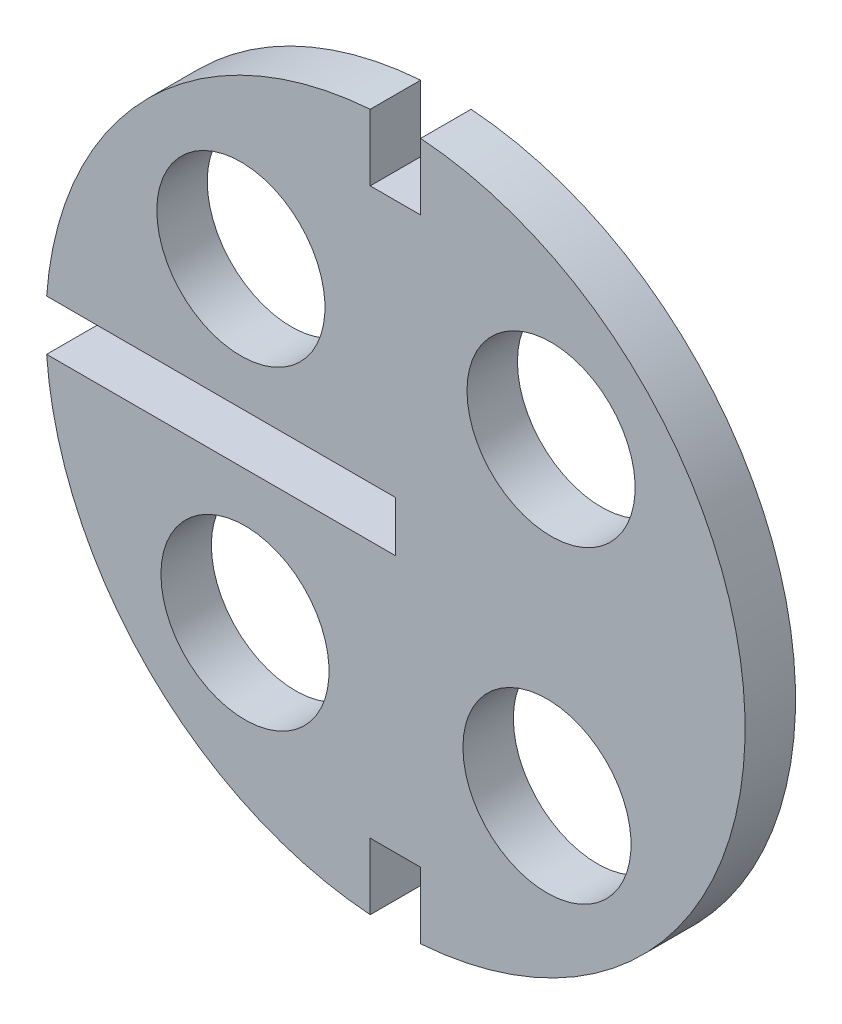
ISO-10303-21;
HEADER;
FILE_DESCRIPTION(('STEP AP214'),'2;1');
FILE_NAME('part.step','',(''),(''),'','','');
FILE_SCHEMA(('AUTOMOTIVE_DESIGN { 1 0 10303 214 1 1 1 1 }'));
ENDSEC;
DATA;
#1=APPLICATION_CONTEXT('core data for automotive mechanical design processes');
#2=APPLICATION_PROTOCOL_DEFINITION('international standard','automotive_design',2000,#1);
#3=PRODUCT_CONTEXT('',#1,'mechanical');
#4=PRODUCT('Part','Part','',(#3));
#5=PRODUCT_RELATED_PRODUCT_CATEGORY('part','',(#4));
#6=PRODUCT_DEFINITION_FORMATION('','',#4);
#7=PRODUCT_DEFINITION_CONTEXT('part definition',#1,'design');
#8=PRODUCT_DEFINITION('design','',#6,#7);
#9=PRODUCT_DEFINITION_SHAPE('','',#8);
#10=(LENGTH_UNIT() NAMED_UNIT(*) SI_UNIT(.MILLI.,.METRE.));
#11=(NAMED_UNIT(*) PLANE_ANGLE_UNIT() SI_UNIT($,.RADIAN.));
#12=(NAMED_UNIT(*) SI_UNIT($,.STERADIAN.) SOLID_ANGLE_UNIT());
#13=UNCERTAINTY_MEASURE_WITH_UNIT(LENGTH_MEASURE(1.E-05),#10,'distance_accuracy_value','');
#14=(GEOMETRIC_REPRESENTATION_CONTEXT(3) GLOBAL_UNCERTAINTY_ASSIGNED_CONTEXT((#13)) GLOBAL_UNIT_ASSIGNED_CONTEXT((#10,
#11,#12)) REPRESENTATION_CONTEXT('',''));
#15=CARTESIAN_POINT('',(0.,0.,0.));
#16=DIRECTION('',(0.,0.,1.));
#17=DIRECTION('',(1.,0.,0.));
#18=AXIS2_PLACEMENT_3D('',#15,#16,#17);
#19=CARTESIAN_POINT('',(0.,0.,3.81));
#20=DIRECTION('',(0.,0.,1.));
#21=DIRECTION('',(1.,0.,0.));
#22=AXIS2_PLACEMENT_3D('',#19,#20,#21);
#23=PLANE('',#22);
#24=CARTESIAN_POINT('',(-11.3642808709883,-11.9763608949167,3.81));
#25=DIRECTION('',(0.,0.,1.));
#26=DIRECTION('',(1.,0.,0.));
#27=AXIS2_PLACEMENT_3D('',#24,#25,#26);
#28=CIRCLE('',#27,6.35);
#29=CARTESIAN_POINT('',(-17.7142808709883,-11.9763608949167,3.81));
#30=VERTEX_POINT('',#29);
#31=EDGE_CURVE('E195',#30,#30,#28,.T.);
#32=ORIENTED_EDGE('',*,*,#31,.F.);
#33=EDGE_LOOP('',(#32));
#34=FACE_BOUND('',#33,.T.);
#35=CARTESIAN_POINT('',(11.7568886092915,11.5911893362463,3.81));
#36=DIRECTION('',(0.,0.,1.));
#37=DIRECTION('',(1.,0.,0.));
#38=AXIS2_PLACEMENT_3D('',#35,#36,#37);
#39=CIRCLE('',#38,6.35);
#40=CARTESIAN_POINT('',(5.40688860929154,11.5911893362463,3.81));
#41=VERTEX_POINT('',#40);
#42=EDGE_CURVE('E207',#41,#41,#39,.T.);
#43=ORIENTED_EDGE('',*,*,#42,.F.);
#44=EDGE_LOOP('',(#43));
#45=FACE_BOUND('',#44,.T.);
#46=CARTESIAN_POINT('',(-11.6743329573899,11.6743329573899,3.81));
#47=DIRECTION('',(0.,0.,1.));
#48=DIRECTION('',(1.,0.,0.));
#49=AXIS2_PLACEMENT_3D('',#46,#47,#48);
#50=CIRCLE('',#49,6.35);
#51=CARTESIAN_POINT('',(-18.0243329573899,11.6743329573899,3.81));
#52=VERTEX_POINT('',#51);
#53=EDGE_CURVE('E213',#52,#52,#50,.T.);
#54=ORIENTED_EDGE('',*,*,#53,.F.);
#55=EDGE_LOOP('',(#54));
#56=FACE_BOUND('',#55,.T.);
#57=CARTESIAN_POINT('',(11.4489030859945,-11.8954915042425,3.81));
#58=DIRECTION('',(0.,0.,1.));
#59=DIRECTION('',(1.,0.,0.));
#60=AXIS2_PLACEMENT_3D('',#57,#58,#59);
#61=CIRCLE('',#60,6.35);
#62=CARTESIAN_POINT('',(5.09890308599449,-11.8954915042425,3.81));
#63=VERTEX_POINT('',#62);
#64=EDGE_CURVE('E201',#63,#63,#61,.T.);
#65=ORIENTED_EDGE('',*,*,#64,.F.);
#66=EDGE_LOOP('',(#65));
#67=FACE_BOUND('',#66,.T.);
#68=DIRECTION('',(0.,1.,0.));
#69=VECTOR('',#68,1.);
#70=CARTESIAN_POINT('',(0.,1.905,3.81));
#71=LINE('',#70,#69);
#72=CARTESIAN_POINT('',(0.,-1.905,3.81));
#73=VERTEX_POINT('',#72);
#74=CARTESIAN_POINT('',(0.,1.905,3.81));
#75=VERTEX_POINT('',#74);
#76=EDGE_CURVE('E149',#73,#75,#71,.T.);
#77=ORIENTED_EDGE('',*,*,#76,.F.);
#78=DIRECTION('',(1.,0.,0.));
#79=VECTOR('',#78,1.);
#80=CARTESIAN_POINT('',(-28.3013574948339,-1.905,3.81));
#81=LINE('',#80,#79);
#82=CARTESIAN_POINT('',(-26.3472205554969,-1.905,3.81));
#83=VERTEX_POINT('',#82);
#84=EDGE_CURVE('E127',#83,#73,#81,.T.);
#85=ORIENTED_EDGE('',*,*,#84,.F.);
#86=CARTESIAN_POINT('',(0.,0.,3.81));
#87=DIRECTION('',(0.,0.,1.));
#88=DIRECTION('',(1.,0.,0.));
#89=AXIS2_PLACEMENT_3D('',#86,#87,#88);
#90=CIRCLE('',#89,26.416);
#91=CARTESIAN_POINT('',(-1.905,-26.3472205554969,3.81));
#92=VERTEX_POINT('',#91);
#93=EDGE_CURVE('E54',#83,#92,#90,.T.);
#94=ORIENTED_EDGE('',*,*,#93,.T.);
#95=DIRECTION('',(0.,-1.,0.));
#96=VECTOR('',#95,1.);
#97=CARTESIAN_POINT('',(-1.905,-27.9234461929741,3.81));
#98=LINE('',#97,#96);
#99=CARTESIAN_POINT('',(-1.905,-21.336,3.81));
#100=VERTEX_POINT('',#99);
#101=EDGE_CURVE('E164',#100,#92,#98,.T.);
#102=ORIENTED_EDGE('',*,*,#101,.F.);
#103=DIRECTION('',(-1.,0.,0.));
#104=VECTOR('',#103,1.);
#105=CARTESIAN_POINT('',(1.905,-21.336,3.81));
#106=LINE('',#105,#104);
#107=CARTESIAN_POINT('',(1.905,-21.336,3.81));
#108=VERTEX_POINT('',#107);
#109=EDGE_CURVE('E162',#108,#100,#106,.T.);
#110=ORIENTED_EDGE('',*,*,#109,.F.);
#111=DIRECTION('',(0.,1.,0.));
#112=VECTOR('',#111,1.);
#113=CARTESIAN_POINT('',(1.905,-27.9234461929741,3.81));
#114=LINE('',#113,#112);
#115=CARTESIAN_POINT('',(1.905,-26.3472205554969,3.81));
#116=VERTEX_POINT('',#115);
#117=EDGE_CURVE('E160',#116,#108,#114,.T.);
#118=ORIENTED_EDGE('',*,*,#117,.F.);
#119=CARTESIAN_POINT('',(1.905,26.3472205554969,3.81));
#120=VERTEX_POINT('',#119);
#121=EDGE_CURVE('E220',#116,#120,#90,.T.);
#122=ORIENTED_EDGE('',*,*,#121,.T.);
#123=DIRECTION('',(0.,1.,0.));
#124=VECTOR('',#123,1.);
#125=CARTESIAN_POINT('',(1.905,27.419564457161,3.81));
#126=LINE('',#125,#124);
#127=CARTESIAN_POINT('',(1.905,21.336,3.81));
#128=VERTEX_POINT('',#127);
#129=EDGE_CURVE('E184',#128,#120,#126,.T.);
#130=ORIENTED_EDGE('',*,*,#129,.F.);
#131=DIRECTION('',(1.,0.,0.));
#132=VECTOR('',#131,1.);
#133=CARTESIAN_POINT('',(-1.905,21.336,3.81));
#134=LINE('',#133,#132);
#135=CARTESIAN_POINT('',(-1.905,21.336,3.81));
#136=VERTEX_POINT('',#135);
#137=EDGE_CURVE('E182',#136,#128,#134,.T.);
#138=ORIENTED_EDGE('',*,*,#137,.F.);
#139=DIRECTION('',(0.,-1.,0.));
#140=VECTOR('',#139,1.);
#141=CARTESIAN_POINT('',(-1.905,27.419564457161,3.81));
#142=LINE('',#141,#140);
#143=CARTESIAN_POINT('',(-1.905,26.3472205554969,3.81));
#144=VERTEX_POINT('',#143);
#145=EDGE_CURVE('E180',#144,#136,#142,.T.);
#146=ORIENTED_EDGE('',*,*,#145,.F.);
#147=CARTESIAN_POINT('',(-26.3472205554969,1.905,3.81));
#148=VERTEX_POINT('',#147);
#149=EDGE_CURVE('E221',#144,#148,#90,.T.);
#150=ORIENTED_EDGE('',*,*,#149,.T.);
#151=DIRECTION('',(-1.,0.,0.));
#152=VECTOR('',#151,1.);
#153=CARTESIAN_POINT('',(-28.3013574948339,1.905,3.81));
#154=LINE('',#153,#152);
#155=EDGE_CURVE('E46',#75,#148,#154,.T.);
#156=ORIENTED_EDGE('',*,*,#155,.F.);
#157=EDGE_LOOP('',(#77,#85,#94,#102,#110,#118,#122,#130,#138,#146,#150,#156));
#158=FACE_BOUND('',#157,.T.);
#159=ADVANCED_FACE('F31',(#34,#45,#56,#67,#158),#23,.T.);
#160=CARTESIAN_POINT('',(0.,0.,0.));
#161=DIRECTION('',(0.,0.,1.));
#162=DIRECTION('',(1.,0.,0.));
#163=AXIS2_PLACEMENT_3D('',#160,#161,#162);
#164=PLANE('',#163);
#165=CARTESIAN_POINT('',(-11.3642808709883,-11.9763608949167,0.));
#166=DIRECTION('',(0.,0.,1.));
#167=DIRECTION('',(1.,0.,0.));
#168=AXIS2_PLACEMENT_3D('',#165,#166,#167);
#169=CIRCLE('',#168,6.35);
#170=CARTESIAN_POINT('',(-17.7142808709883,-11.9763608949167,0.));
#171=VERTEX_POINT('',#170);
#172=EDGE_CURVE('E192',#171,#171,#169,.T.);
#173=ORIENTED_EDGE('',*,*,#172,.T.);
#174=EDGE_LOOP('',(#173));
#175=FACE_BOUND('',#174,.T.);
#176=CARTESIAN_POINT('',(11.7568886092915,11.5911893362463,0.));
#177=DIRECTION('',(0.,0.,1.));
#178=DIRECTION('',(1.,0.,0.));
#179=AXIS2_PLACEMENT_3D('',#176,#177,#178);
#180=CIRCLE('',#179,6.35);
#181=CARTESIAN_POINT('',(5.40688860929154,11.5911893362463,0.));
#182=VERTEX_POINT('',#181);
#183=EDGE_CURVE('E204',#182,#182,#180,.T.);
#184=ORIENTED_EDGE('',*,*,#183,.T.);
#185=EDGE_LOOP('',(#184));
#186=FACE_BOUND('',#185,.T.);
#187=CARTESIAN_POINT('',(-11.6743329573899,11.6743329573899,0.));
#188=DIRECTION('',(0.,0.,1.));
#189=DIRECTION('',(1.,0.,0.));
#190=AXIS2_PLACEMENT_3D('',#187,#188,#189);
#191=CIRCLE('',#190,6.35);
#192=CARTESIAN_POINT('',(-18.0243329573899,11.6743329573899,0.));
#193=VERTEX_POINT('',#192);
#194=EDGE_CURVE('E210',#193,#193,#191,.T.);
#195=ORIENTED_EDGE('',*,*,#194,.T.);
#196=EDGE_LOOP('',(#195));
#197=FACE_BOUND('',#196,.T.);
#198=CARTESIAN_POINT('',(11.4489030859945,-11.8954915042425,0.));
#199=DIRECTION('',(0.,0.,1.));
#200=DIRECTION('',(1.,0.,0.));
#201=AXIS2_PLACEMENT_3D('',#198,#199,#200);
#202=CIRCLE('',#201,6.35);
#203=CARTESIAN_POINT('',(5.09890308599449,-11.8954915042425,0.));
#204=VERTEX_POINT('',#203);
#205=EDGE_CURVE('E198',#204,#204,#202,.T.);
#206=ORIENTED_EDGE('',*,*,#205,.T.);
#207=EDGE_LOOP('',(#206));
#208=FACE_BOUND('',#207,.T.);
#209=DIRECTION('',(1.,0.,0.));
#210=VECTOR('',#209,1.);
#211=CARTESIAN_POINT('',(-28.3013574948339,-1.905,0.));
#212=LINE('',#211,#210);
#213=CARTESIAN_POINT('',(-26.3472205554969,-1.905,0.));
#214=VERTEX_POINT('',#213);
#215=CARTESIAN_POINT('',(0.,-1.905,0.));
#216=VERTEX_POINT('',#215);
#217=EDGE_CURVE('E125',#214,#216,#212,.T.);
#218=ORIENTED_EDGE('',*,*,#217,.T.);
#219=DIRECTION('',(0.,1.,0.));
#220=VECTOR('',#219,1.);
#221=CARTESIAN_POINT('',(0.,1.905,0.));
#222=LINE('',#221,#220);
#223=CARTESIAN_POINT('',(0.,1.905,0.));
#224=VERTEX_POINT('',#223);
#225=EDGE_CURVE('E134',#216,#224,#222,.T.);
#226=ORIENTED_EDGE('',*,*,#225,.T.);
#227=DIRECTION('',(-1.,0.,0.));
#228=VECTOR('',#227,1.);
#229=CARTESIAN_POINT('',(-28.3013574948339,1.905,0.));
#230=LINE('',#229,#228);
#231=CARTESIAN_POINT('',(-26.3472205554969,1.905,0.));
#232=VERTEX_POINT('',#231);
#233=EDGE_CURVE('E139',#224,#232,#230,.T.);
#234=ORIENTED_EDGE('',*,*,#233,.T.);
#235=CARTESIAN_POINT('',(0.,0.,0.));
#236=DIRECTION('',(0.,0.,1.));
#237=DIRECTION('',(1.,0.,0.));
#238=AXIS2_PLACEMENT_3D('',#235,#236,#237);
#239=CIRCLE('',#238,26.416);
#240=CARTESIAN_POINT('',(-1.905,26.3472205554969,0.));
#241=VERTEX_POINT('',#240);
#242=EDGE_CURVE('E217',#241,#232,#239,.T.);
#243=ORIENTED_EDGE('',*,*,#242,.F.);
#244=DIRECTION('',(0.,-1.,0.));
#245=VECTOR('',#244,1.);
#246=CARTESIAN_POINT('',(-1.905,27.419564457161,0.));
#247=LINE('',#246,#245);
#248=CARTESIAN_POINT('',(-1.905,21.336,0.));
#249=VERTEX_POINT('',#248);
#250=EDGE_CURVE('E171',#241,#249,#247,.T.);
#251=ORIENTED_EDGE('',*,*,#250,.T.);
#252=DIRECTION('',(1.,0.,0.));
#253=VECTOR('',#252,1.);
#254=CARTESIAN_POINT('',(-1.905,21.336,0.));
#255=LINE('',#254,#253);
#256=CARTESIAN_POINT('',(1.905,21.336,0.));
#257=VERTEX_POINT('',#256);
#258=EDGE_CURVE('E174',#249,#257,#255,.T.);
#259=ORIENTED_EDGE('',*,*,#258,.T.);
#260=DIRECTION('',(0.,1.,0.));
#261=VECTOR('',#260,1.);
#262=CARTESIAN_POINT('',(1.905,27.419564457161,0.));
#263=LINE('',#262,#261);
#264=CARTESIAN_POINT('',(1.905,26.3472205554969,0.));
#265=VERTEX_POINT('',#264);
#266=EDGE_CURVE('E177',#257,#265,#263,.T.);
#267=ORIENTED_EDGE('',*,*,#266,.T.);
#268=CARTESIAN_POINT('',(1.905,-26.3472205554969,0.));
#269=VERTEX_POINT('',#268);
#270=EDGE_CURVE('E216',#269,#265,#239,.T.);
#271=ORIENTED_EDGE('',*,*,#270,.F.);
#272=DIRECTION('',(0.,1.,0.));
#273=VECTOR('',#272,1.);
#274=CARTESIAN_POINT('',(1.905,-27.9234461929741,0.));
#275=LINE('',#274,#273);
#276=CARTESIAN_POINT('',(1.905,-21.336,0.));
#277=VERTEX_POINT('',#276);
#278=EDGE_CURVE('E130',#269,#277,#275,.T.);
#279=ORIENTED_EDGE('',*,*,#278,.T.);
#280=DIRECTION('',(-1.,0.,0.));
#281=VECTOR('',#280,1.);
#282=CARTESIAN_POINT('',(1.905,-21.336,0.));
#283=LINE('',#282,#281);
#284=CARTESIAN_POINT('',(-1.905,-21.336,0.));
#285=VERTEX_POINT('',#284);
#286=EDGE_CURVE('E155',#277,#285,#283,.T.);
#287=ORIENTED_EDGE('',*,*,#286,.T.);
#288=DIRECTION('',(0.,-1.,0.));
#289=VECTOR('',#288,1.);
#290=CARTESIAN_POINT('',(-1.905,-27.9234461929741,0.));
#291=LINE('',#290,#289);
#292=CARTESIAN_POINT('',(-1.905,-26.3472205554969,0.));
#293=VERTEX_POINT('',#292);
#294=EDGE_CURVE('E158',#285,#293,#291,.T.);
#295=ORIENTED_EDGE('',*,*,#294,.T.);
#296=EDGE_CURVE('E144',#214,#293,#239,.T.);
#297=ORIENTED_EDGE('',*,*,#296,.F.);
#298=EDGE_LOOP('',(#218,#226,#234,#243,#251,#259,#267,#271,#279,#287,#295,#297));
#299=FACE_BOUND('',#298,.T.);
#300=ADVANCED_FACE('F142',(#175,#186,#197,#208,#299),#164,.F.);
#301=CARTESIAN_POINT('',(0.,0.,3.81));
#302=DIRECTION('',(0.,0.,-1.));
#303=DIRECTION('',(-1.,0.,0.));
#304=AXIS2_PLACEMENT_3D('',#301,#302,#303);
#305=CYLINDRICAL_SURFACE('',#304,26.416);
#306=DIRECTION('',(0.,0.,-1.));
#307=VECTOR('',#306,1.);
#308=CARTESIAN_POINT('',(-26.3472205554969,-1.905,3.81));
#309=LINE('',#308,#307);
#310=EDGE_CURVE('E11',#214,#83,#309,.F.);
#311=ORIENTED_EDGE('',*,*,#310,.F.);
#312=ORIENTED_EDGE('',*,*,#296,.T.);
#313=DIRECTION('',(0.,0.,-1.));
#314=VECTOR('',#313,1.);
#315=CARTESIAN_POINT('',(-1.905,-26.3472205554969,3.81));
#316=LINE('',#315,#314);
#317=EDGE_CURVE('E229',#92,#293,#316,.T.);
#318=ORIENTED_EDGE('',*,*,#317,.F.);
#319=ORIENTED_EDGE('',*,*,#93,.F.);
#320=EDGE_LOOP('',(#311,#312,#318,#319));
#321=FACE_BOUND('',#320,.T.);
#322=ADVANCED_FACE('F257',(#321),#305,.T.);
#323=DIRECTION('',(0.,0.,-1.));
#324=VECTOR('',#323,1.);
#325=CARTESIAN_POINT('',(-26.3472205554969,1.905,3.81));
#326=LINE('',#325,#324);
#327=EDGE_CURVE('E39',#148,#232,#326,.T.);
#328=ORIENTED_EDGE('',*,*,#327,.F.);
#329=ORIENTED_EDGE('',*,*,#149,.F.);
#330=DIRECTION('',(0.,0.,-1.));
#331=VECTOR('',#330,1.);
#332=CARTESIAN_POINT('',(-1.905,26.3472205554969,3.81));
#333=LINE('',#332,#331);
#334=EDGE_CURVE('E227',#241,#144,#333,.F.);
#335=ORIENTED_EDGE('',*,*,#334,.F.);
#336=ORIENTED_EDGE('',*,*,#242,.T.);
#337=EDGE_LOOP('',(#328,#329,#335,#336));
#338=FACE_BOUND('',#337,.T.);
#339=ADVANCED_FACE('F238',(#338),#305,.T.);
#340=DIRECTION('',(0.,0.,-1.));
#341=VECTOR('',#340,1.);
#342=CARTESIAN_POINT('',(1.905,-26.3472205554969,3.81));
#343=LINE('',#342,#341);
#344=EDGE_CURVE('E232',#269,#116,#343,.F.);
#345=ORIENTED_EDGE('',*,*,#344,.F.);
#346=ORIENTED_EDGE('',*,*,#270,.T.);
#347=DIRECTION('',(0.,0.,-1.));
#348=VECTOR('',#347,1.);
#349=CARTESIAN_POINT('',(1.905,26.3472205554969,3.81));
#350=LINE('',#349,#348);
#351=EDGE_CURVE('E224',#120,#265,#350,.T.);
#352=ORIENTED_EDGE('',*,*,#351,.F.);
#353=ORIENTED_EDGE('',*,*,#121,.F.);
#354=EDGE_LOOP('',(#345,#346,#352,#353));
#355=FACE_BOUND('',#354,.T.);
#356=ADVANCED_FACE('F33',(#355),#305,.T.);
#357=CARTESIAN_POINT('',(-11.6743329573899,11.6743329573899,3.81));
#358=DIRECTION('',(0.,0.,-1.));
#359=DIRECTION('',(-1.,0.,0.));
#360=AXIS2_PLACEMENT_3D('',#357,#358,#359);
#361=CYLINDRICAL_SURFACE('',#360,6.35);
#362=CARTESIAN_POINT('',(-18.0243329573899,11.6743329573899,3.81));
#363=CARTESIAN_POINT('',(-18.0243329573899,11.6743329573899,3.7703125));
#364=CARTESIAN_POINT('',(-18.0243329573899,11.6743329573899,3.730625));
#365=CARTESIAN_POINT('',(-18.0243329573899,11.6743329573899,3.65125));
#366=CARTESIAN_POINT('',(-18.0243329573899,11.6743329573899,3.6115625));
#367=CARTESIAN_POINT('',(-18.0243329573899,11.6743329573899,3.5321875));
#368=CARTESIAN_POINT('',(-18.0243329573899,11.6743329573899,3.4925));
#369=CARTESIAN_POINT('',(-18.0243329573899,11.6743329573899,3.413125));
#370=CARTESIAN_POINT('',(-18.0243329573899,11.6743329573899,3.3734375));
#371=CARTESIAN_POINT('',(-18.0243329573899,11.6743329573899,3.2940625));
#372=CARTESIAN_POINT('',(-18.0243329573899,11.6743329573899,3.254375));
#373=CARTESIAN_POINT('',(-18.0243329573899,11.6743329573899,3.175));
#374=CARTESIAN_POINT('',(-18.0243329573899,11.6743329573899,3.1353125));
#375=CARTESIAN_POINT('',(-18.0243329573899,11.6743329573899,3.0559375));
#376=CARTESIAN_POINT('',(-18.0243329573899,11.6743329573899,3.01625));
#377=CARTESIAN_POINT('',(-18.0243329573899,11.6743329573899,2.936875));
#378=CARTESIAN_POINT('',(-18.0243329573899,11.6743329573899,2.8971875));
#379=CARTESIAN_POINT('',(-18.0243329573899,11.6743329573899,2.8178125));
#380=CARTESIAN_POINT('',(-18.0243329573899,11.6743329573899,2.778125));
#381=CARTESIAN_POINT('',(-18.0243329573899,11.6743329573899,2.69875));
#382=CARTESIAN_POINT('',(-18.0243329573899,11.6743329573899,2.6590625));
#383=CARTESIAN_POINT('',(-18.0243329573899,11.6743329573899,2.5796875));
#384=CARTESIAN_POINT('',(-18.0243329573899,11.6743329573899,2.54));
#385=CARTESIAN_POINT('',(-18.0243329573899,11.6743329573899,2.460625));
#386=CARTESIAN_POINT('',(-18.0243329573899,11.6743329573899,2.4209375));
#387=CARTESIAN_POINT('',(-18.0243329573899,11.6743329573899,2.3415625));
#388=CARTESIAN_POINT('',(-18.0243329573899,11.6743329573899,2.301875));
#389=CARTESIAN_POINT('',(-18.0243329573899,11.6743329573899,2.2225));
#390=CARTESIAN_POINT('',(-18.0243329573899,11.6743329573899,2.1828125));
#391=CARTESIAN_POINT('',(-18.0243329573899,11.6743329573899,2.1034375));
#392=CARTESIAN_POINT('',(-18.0243329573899,11.6743329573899,2.06375));
#393=CARTESIAN_POINT('',(-18.0243329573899,11.6743329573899,1.984375));
#394=CARTESIAN_POINT('',(-18.0243329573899,11.6743329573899,1.9446875));
#395=CARTESIAN_POINT('',(-18.0243329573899,11.6743329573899,1.8653125));
#396=CARTESIAN_POINT('',(-18.0243329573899,11.6743329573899,1.825625));
#397=CARTESIAN_POINT('',(-18.0243329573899,11.6743329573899,1.74625));
#398=CARTESIAN_POINT('',(-18.0243329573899,11.6743329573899,1.7065625));
#399=CARTESIAN_POINT('',(-18.0243329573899,11.6743329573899,1.6271875));
#400=CARTESIAN_POINT('',(-18.0243329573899,11.6743329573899,1.5875));
#401=CARTESIAN_POINT('',(-18.0243329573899,11.6743329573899,1.508125));
#402=CARTESIAN_POINT('',(-18.0243329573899,11.6743329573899,1.4684375));
#403=CARTESIAN_POINT('',(-18.0243329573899,11.6743329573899,1.3890625));
#404=CARTESIAN_POINT('',(-18.0243329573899,11.6743329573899,1.349375));
#405=CARTESIAN_POINT('',(-18.0243329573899,11.6743329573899,1.27));
#406=CARTESIAN_POINT('',(-18.0243329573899,11.6743329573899,1.2303125));
#407=CARTESIAN_POINT('',(-18.0243329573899,11.6743329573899,1.1509375));
#408=CARTESIAN_POINT('',(-18.0243329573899,11.6743329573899,1.11125));
#409=CARTESIAN_POINT('',(-18.0243329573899,11.6743329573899,1.031875));
#410=CARTESIAN_POINT('',(-18.0243329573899,11.6743329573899,0.9921875));
#411=CARTESIAN_POINT('',(-18.0243329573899,11.6743329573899,0.9128125));
#412=CARTESIAN_POINT('',(-18.0243329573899,11.6743329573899,0.873125));
#413=CARTESIAN_POINT('',(-18.0243329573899,11.6743329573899,0.79375));
#414=CARTESIAN_POINT('',(-18.0243329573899,11.6743329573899,0.7540625));
#415=CARTESIAN_POINT('',(-18.0243329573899,11.6743329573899,0.6746875));
#416=CARTESIAN_POINT('',(-18.0243329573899,11.6743329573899,0.635));
#417=CARTESIAN_POINT('',(-18.0243329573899,11.6743329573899,0.555625));
#418=CARTESIAN_POINT('',(-18.0243329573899,11.6743329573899,0.5159375));
#419=CARTESIAN_POINT('',(-18.0243329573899,11.6743329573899,0.4365625));
#420=CARTESIAN_POINT('',(-18.0243329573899,11.6743329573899,0.396875));
#421=CARTESIAN_POINT('',(-18.0243329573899,11.6743329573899,0.3175));
#422=CARTESIAN_POINT('',(-18.0243329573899,11.6743329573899,0.2778125));
#423=CARTESIAN_POINT('',(-18.0243329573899,11.6743329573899,0.1984375));
#424=CARTESIAN_POINT('',(-18.0243329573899,11.6743329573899,0.15875));
#425=CARTESIAN_POINT('',(-18.0243329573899,11.6743329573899,0.0793749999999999));
#426=CARTESIAN_POINT('',(-18.0243329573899,11.6743329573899,0.0396874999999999));
#427=CARTESIAN_POINT('',(-18.0243329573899,11.6743329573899,0.));
#428=B_SPLINE_CURVE_WITH_KNOTS('',3,(#362,#363,#364,#365,#366,#367,#368,#369,#370,#371,#372,
#373,#374,#375,#376,#377,#378,#379,#380,#381,#382,#383,#384,#385,#386,#387,#388,#389,#390,#391,
#392,#393,#394,#395,#396,#397,#398,#399,#400,#401,#402,#403,#404,#405,#406,#407,#408,#409,#410,
#411,#412,#413,#414,#415,#416,#417,#418,#419,#420,#421,#422,#423,#424,#425,#426,#427),
.UNSPECIFIED.,.F.,.F.,(4,2,2,2,2,2,2,2,2,2,2,2,2,2,2,2,2,2,2,2,2,2,2,2,2,2,2,2,2,2,2,2,4),(0.,
0.1190625,0.238125,0.3571875,0.47625,0.5953125,0.714375,0.8334375,0.9525,1.0715625,1.190625,
1.3096875,1.42875,1.5478125,1.666875,1.7859375,1.905,2.0240625,2.143125,2.2621875,2.38125,
2.5003125,2.619375,2.7384375,2.8575,2.9765625,3.095625,3.2146875,3.33375,3.4528125,3.571875,
3.6909375,3.81),.UNSPECIFIED.);
#429=EDGE_CURVE('BSEAM271',#52,#193,#428,.T.);
#430=ORIENTED_EDGE('',*,*,#53,.T.);
#431=ORIENTED_EDGE('',*,*,#194,.F.);
#432=ORIENTED_EDGE('',*,*,#429,.T.);
#433=ORIENTED_EDGE('',*,*,#429,.F.);
#434=EDGE_LOOP('',(#430,#432,#431,#433));
#435=FACE_BOUND('',#434,.T.);
#436=ADVANCED_FACE('F271',(#435),#361,.F.);
#437=CARTESIAN_POINT('',(11.7568886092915,11.5911893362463,3.81));
#438=DIRECTION('',(0.,0.,-1.));
#439=DIRECTION('',(-1.,0.,0.));
#440=AXIS2_PLACEMENT_3D('',#437,#438,#439);
#441=CYLINDRICAL_SURFACE('',#440,6.35);
#442=CARTESIAN_POINT('',(5.40688860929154,11.5911893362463,3.81));
#443=CARTESIAN_POINT('',(5.40688860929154,11.5911893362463,3.7703125));
#444=CARTESIAN_POINT('',(5.40688860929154,11.5911893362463,3.730625));
#445=CARTESIAN_POINT('',(5.40688860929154,11.5911893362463,3.65125));
#446=CARTESIAN_POINT('',(5.40688860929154,11.5911893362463,3.6115625));
#447=CARTESIAN_POINT('',(5.40688860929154,11.5911893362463,3.5321875));
#448=CARTESIAN_POINT('',(5.40688860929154,11.5911893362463,3.4925));
#449=CARTESIAN_POINT('',(5.40688860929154,11.5911893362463,3.413125));
#450=CARTESIAN_POINT('',(5.40688860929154,11.5911893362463,3.3734375));
#451=CARTESIAN_POINT('',(5.40688860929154,11.5911893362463,3.2940625));
#452=CARTESIAN_POINT('',(5.40688860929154,11.5911893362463,3.254375));
#453=CARTESIAN_POINT('',(5.40688860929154,11.5911893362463,3.175));
#454=CARTESIAN_POINT('',(5.40688860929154,11.5911893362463,3.1353125));
#455=CARTESIAN_POINT('',(5.40688860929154,11.5911893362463,3.0559375));
#456=CARTESIAN_POINT('',(5.40688860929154,11.5911893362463,3.01625));
#457=CARTESIAN_POINT('',(5.40688860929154,11.5911893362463,2.936875));
#458=CARTESIAN_POINT('',(5.40688860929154,11.5911893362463,2.8971875));
#459=CARTESIAN_POINT('',(5.40688860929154,11.5911893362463,2.8178125));
#460=CARTESIAN_POINT('',(5.40688860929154,11.5911893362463,2.778125));
#461=CARTESIAN_POINT('',(5.40688860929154,11.5911893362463,2.69875));
#462=CARTESIAN_POINT('',(5.40688860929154,11.5911893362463,2.6590625));
#463=CARTESIAN_POINT('',(5.40688860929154,11.5911893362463,2.5796875));
#464=CARTESIAN_POINT('',(5.40688860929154,11.5911893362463,2.54));
#465=CARTESIAN_POINT('',(5.40688860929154,11.5911893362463,2.460625));
#466=CARTESIAN_POINT('',(5.40688860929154,11.5911893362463,2.4209375));
#467=CARTESIAN_POINT('',(5.40688860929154,11.5911893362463,2.3415625));
#468=CARTESIAN_POINT('',(5.40688860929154,11.5911893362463,2.301875));
#469=CARTESIAN_POINT('',(5.40688860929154,11.5911893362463,2.2225));
#470=CARTESIAN_POINT('',(5.40688860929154,11.5911893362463,2.1828125));
#471=CARTESIAN_POINT('',(5.40688860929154,11.5911893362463,2.1034375));
#472=CARTESIAN_POINT('',(5.40688860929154,11.5911893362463,2.06375));
#473=CARTESIAN_POINT('',(5.40688860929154,11.5911893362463,1.984375));
#474=CARTESIAN_POINT('',(5.40688860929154,11.5911893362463,1.9446875));
#475=CARTESIAN_POINT('',(5.40688860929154,11.5911893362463,1.8653125));
#476=CARTESIAN_POINT('',(5.40688860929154,11.5911893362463,1.825625));
#477=CARTESIAN_POINT('',(5.40688860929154,11.5911893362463,1.74625));
#478=CARTESIAN_POINT('',(5.40688860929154,11.5911893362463,1.7065625));
#479=CARTESIAN_POINT('',(5.40688860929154,11.5911893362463,1.6271875));
#480=CARTESIAN_POINT('',(5.40688860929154,11.5911893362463,1.5875));
#481=CARTESIAN_POINT('',(5.40688860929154,11.5911893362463,1.508125));
#482=CARTESIAN_POINT('',(5.40688860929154,11.5911893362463,1.4684375));
#483=CARTESIAN_POINT('',(5.40688860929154,11.5911893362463,1.3890625));
#484=CARTESIAN_POINT('',(5.40688860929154,11.5911893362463,1.349375));
#485=CARTESIAN_POINT('',(5.40688860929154,11.5911893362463,1.27));
#486=CARTESIAN_POINT('',(5.40688860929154,11.5911893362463,1.2303125));
#487=CARTESIAN_POINT('',(5.40688860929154,11.5911893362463,1.1509375));
#488=CARTESIAN_POINT('',(5.40688860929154,11.5911893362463,1.11125));
#489=CARTESIAN_POINT('',(5.40688860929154,11.5911893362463,1.031875));
#490=CARTESIAN_POINT('',(5.40688860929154,11.5911893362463,0.9921875));
#491=CARTESIAN_POINT('',(5.40688860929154,11.5911893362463,0.9128125));
#492=CARTESIAN_POINT('',(5.40688860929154,11.5911893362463,0.873125));
#493=CARTESIAN_POINT('',(5.40688860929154,11.5911893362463,0.79375));
#494=CARTESIAN_POINT('',(5.40688860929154,11.5911893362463,0.7540625));
#495=CARTESIAN_POINT('',(5.40688860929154,11.5911893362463,0.6746875));
#496=CARTESIAN_POINT('',(5.40688860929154,11.5911893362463,0.635));
#497=CARTESIAN_POINT('',(5.40688860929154,11.5911893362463,0.555625));
#498=CARTESIAN_POINT('',(5.40688860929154,11.5911893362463,0.5159375));
#499=CARTESIAN_POINT('',(5.40688860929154,11.5911893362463,0.4365625));
#500=CARTESIAN_POINT('',(5.40688860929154,11.5911893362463,0.396875));
#501=CARTESIAN_POINT('',(5.40688860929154,11.5911893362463,0.3175));
#502=CARTESIAN_POINT('',(5.40688860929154,11.5911893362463,0.2778125));
#503=CARTESIAN_POINT('',(5.40688860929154,11.5911893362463,0.1984375));
#504=CARTESIAN_POINT('',(5.40688860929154,11.5911893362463,0.15875));
#505=CARTESIAN_POINT('',(5.40688860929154,11.5911893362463,0.0793749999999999));
#506=CARTESIAN_POINT('',(5.40688860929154,11.5911893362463,0.0396874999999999));
#507=CARTESIAN_POINT('',(5.40688860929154,11.5911893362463,0.));
#508=B_SPLINE_CURVE_WITH_KNOTS('',3,(#442,#443,#444,#445,#446,#447,#448,#449,#450,#451,#452,
#453,#454,#455,#456,#457,#458,#459,#460,#461,#462,#463,#464,#465,#466,#467,#468,#469,#470,#471,
#472,#473,#474,#475,#476,#477,#478,#479,#480,#481,#482,#483,#484,#485,#486,#487,#488,#489,#490,
#491,#492,#493,#494,#495,#496,#497,#498,#499,#500,#501,#502,#503,#504,#505,#506,#507),
.UNSPECIFIED.,.F.,.F.,(4,2,2,2,2,2,2,2,2,2,2,2,2,2,2,2,2,2,2,2,2,2,2,2,2,2,2,2,2,2,2,2,4),(0.,
0.1190625,0.238125,0.3571875,0.47625,0.5953125,0.714375,0.8334375,0.9525,1.0715625,1.190625,
1.3096875,1.42875,1.5478125,1.666875,1.7859375,1.905,2.0240625,2.143125,2.2621875,2.38125,
2.5003125,2.619375,2.7384375,2.8575,2.9765625,3.095625,3.2146875,3.33375,3.4528125,3.571875,
3.6909375,3.81),.UNSPECIFIED.);
#509=EDGE_CURVE('BSEAM276',#41,#182,#508,.T.);
#510=ORIENTED_EDGE('',*,*,#42,.T.);
#511=ORIENTED_EDGE('',*,*,#183,.F.);
#512=ORIENTED_EDGE('',*,*,#509,.T.);
#513=ORIENTED_EDGE('',*,*,#509,.F.);
#514=EDGE_LOOP('',(#510,#512,#511,#513));
#515=FACE_BOUND('',#514,.T.);
#516=ADVANCED_FACE('F276',(#515),#441,.F.);
#517=CARTESIAN_POINT('',(11.4489030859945,-11.8954915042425,3.81));
#518=DIRECTION('',(0.,0.,-1.));
#519=DIRECTION('',(-1.,0.,0.));
#520=AXIS2_PLACEMENT_3D('',#517,#518,#519);
#521=CYLINDRICAL_SURFACE('',#520,6.35);
#522=CARTESIAN_POINT('',(5.09890308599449,-11.8954915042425,3.81));
#523=CARTESIAN_POINT('',(5.09890308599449,-11.8954915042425,3.7703125));
#524=CARTESIAN_POINT('',(5.09890308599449,-11.8954915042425,3.730625));
#525=CARTESIAN_POINT('',(5.09890308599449,-11.8954915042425,3.65125));
#526=CARTESIAN_POINT('',(5.09890308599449,-11.8954915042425,3.6115625));
#527=CARTESIAN_POINT('',(5.09890308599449,-11.8954915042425,3.5321875));
#528=CARTESIAN_POINT('',(5.09890308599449,-11.8954915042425,3.4925));
#529=CARTESIAN_POINT('',(5.09890308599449,-11.8954915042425,3.413125));
#530=CARTESIAN_POINT('',(5.09890308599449,-11.8954915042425,3.3734375));
#531=CARTESIAN_POINT('',(5.09890308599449,-11.8954915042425,3.2940625));
#532=CARTESIAN_POINT('',(5.09890308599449,-11.8954915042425,3.254375));
#533=CARTESIAN_POINT('',(5.09890308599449,-11.8954915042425,3.175));
#534=CARTESIAN_POINT('',(5.09890308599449,-11.8954915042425,3.1353125));
#535=CARTESIAN_POINT('',(5.09890308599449,-11.8954915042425,3.0559375));
#536=CARTESIAN_POINT('',(5.09890308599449,-11.8954915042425,3.01625));
#537=CARTESIAN_POINT('',(5.09890308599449,-11.8954915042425,2.936875));
#538=CARTESIAN_POINT('',(5.09890308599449,-11.8954915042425,2.8971875));
#539=CARTESIAN_POINT('',(5.09890308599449,-11.8954915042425,2.8178125));
#540=CARTESIAN_POINT('',(5.09890308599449,-11.8954915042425,2.778125));
#541=CARTESIAN_POINT('',(5.09890308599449,-11.8954915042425,2.69875));
#542=CARTESIAN_POINT('',(5.09890308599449,-11.8954915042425,2.6590625));
#543=CARTESIAN_POINT('',(5.09890308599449,-11.8954915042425,2.5796875));
#544=CARTESIAN_POINT('',(5.09890308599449,-11.8954915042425,2.54));
#545=CARTESIAN_POINT('',(5.09890308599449,-11.8954915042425,2.460625));
#546=CARTESIAN_POINT('',(5.09890308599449,-11.8954915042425,2.4209375));
#547=CARTESIAN_POINT('',(5.09890308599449,-11.8954915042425,2.3415625));
#548=CARTESIAN_POINT('',(5.09890308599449,-11.8954915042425,2.301875));
#549=CARTESIAN_POINT('',(5.09890308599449,-11.8954915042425,2.2225));
#550=CARTESIAN_POINT('',(5.09890308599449,-11.8954915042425,2.1828125));
#551=CARTESIAN_POINT('',(5.09890308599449,-11.8954915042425,2.1034375));
#552=CARTESIAN_POINT('',(5.09890308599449,-11.8954915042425,2.06375));
#553=CARTESIAN_POINT('',(5.09890308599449,-11.8954915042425,1.984375));
#554=CARTESIAN_POINT('',(5.09890308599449,-11.8954915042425,1.9446875));
#555=CARTESIAN_POINT('',(5.09890308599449,-11.8954915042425,1.8653125));
#556=CARTESIAN_POINT('',(5.09890308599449,-11.8954915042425,1.825625));
#557=CARTESIAN_POINT('',(5.09890308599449,-11.8954915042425,1.74625));
#558=CARTESIAN_POINT('',(5.09890308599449,-11.8954915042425,1.7065625));
#559=CARTESIAN_POINT('',(5.09890308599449,-11.8954915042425,1.6271875));
#560=CARTESIAN_POINT('',(5.09890308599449,-11.8954915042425,1.5875));
#561=CARTESIAN_POINT('',(5.09890308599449,-11.8954915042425,1.508125));
#562=CARTESIAN_POINT('',(5.09890308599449,-11.8954915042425,1.4684375));
#563=CARTESIAN_POINT('',(5.09890308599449,-11.8954915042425,1.3890625));
#564=CARTESIAN_POINT('',(5.09890308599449,-11.8954915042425,1.349375));
#565=CARTESIAN_POINT('',(5.09890308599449,-11.8954915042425,1.27));
#566=CARTESIAN_POINT('',(5.09890308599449,-11.8954915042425,1.2303125));
#567=CARTESIAN_POINT('',(5.09890308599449,-11.8954915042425,1.1509375));
#568=CARTESIAN_POINT('',(5.09890308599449,-11.8954915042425,1.11125));
#569=CARTESIAN_POINT('',(5.09890308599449,-11.8954915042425,1.031875));
#570=CARTESIAN_POINT('',(5.09890308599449,-11.8954915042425,0.9921875));
#571=CARTESIAN_POINT('',(5.09890308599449,-11.8954915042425,0.9128125));
#572=CARTESIAN_POINT('',(5.09890308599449,-11.8954915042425,0.873125));
#573=CARTESIAN_POINT('',(5.09890308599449,-11.8954915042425,0.79375));
#574=CARTESIAN_POINT('',(5.09890308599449,-11.8954915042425,0.7540625));
#575=CARTESIAN_POINT('',(5.09890308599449,-11.8954915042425,0.6746875));
#576=CARTESIAN_POINT('',(5.09890308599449,-11.8954915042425,0.635));
#577=CARTESIAN_POINT('',(5.09890308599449,-11.8954915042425,0.555625));
#578=CARTESIAN_POINT('',(5.09890308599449,-11.8954915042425,0.5159375));
#579=CARTESIAN_POINT('',(5.09890308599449,-11.8954915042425,0.4365625));
#580=CARTESIAN_POINT('',(5.09890308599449,-11.8954915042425,0.396875));
#581=CARTESIAN_POINT('',(5.09890308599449,-11.8954915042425,0.3175));
#582=CARTESIAN_POINT('',(5.09890308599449,-11.8954915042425,0.2778125));
#583=CARTESIAN_POINT('',(5.09890308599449,-11.8954915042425,0.1984375));
#584=CARTESIAN_POINT('',(5.09890308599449,-11.8954915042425,0.15875));
#585=CARTESIAN_POINT('',(5.09890308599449,-11.8954915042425,0.0793749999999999));
#586=CARTESIAN_POINT('',(5.09890308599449,-11.8954915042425,0.0396874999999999));
#587=CARTESIAN_POINT('',(5.09890308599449,-11.8954915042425,0.));
#588=B_SPLINE_CURVE_WITH_KNOTS('',3,(#522,#523,#524,#525,#526,#527,#528,#529,#530,#531,#532,
#533,#534,#535,#536,#537,#538,#539,#540,#541,#542,#543,#544,#545,#546,#547,#548,#549,#550,#551,
#552,#553,#554,#555,#556,#557,#558,#559,#560,#561,#562,#563,#564,#565,#566,#567,#568,#569,#570,
#571,#572,#573,#574,#575,#576,#577,#578,#579,#580,#581,#582,#583,#584,#585,#586,#587),
.UNSPECIFIED.,.F.,.F.,(4,2,2,2,2,2,2,2,2,2,2,2,2,2,2,2,2,2,2,2,2,2,2,2,2,2,2,2,2,2,2,2,4),(0.,
0.1190625,0.238125,0.3571875,0.47625,0.5953125,0.714375,0.8334375,0.9525,1.0715625,1.190625,
1.3096875,1.42875,1.5478125,1.666875,1.7859375,1.905,2.0240625,2.143125,2.2621875,2.38125,
2.5003125,2.619375,2.7384375,2.8575,2.9765625,3.095625,3.2146875,3.33375,3.4528125,3.571875,
3.6909375,3.81),.UNSPECIFIED.);
#589=EDGE_CURVE('BSEAM292',#63,#204,#588,.T.);
#590=ORIENTED_EDGE('',*,*,#64,.T.);
#591=ORIENTED_EDGE('',*,*,#205,.F.);
#592=ORIENTED_EDGE('',*,*,#589,.T.);
#593=ORIENTED_EDGE('',*,*,#589,.F.);
#594=EDGE_LOOP('',(#590,#592,#591,#593));
#595=FACE_BOUND('',#594,.T.);
#596=ADVANCED_FACE('F292',(#595),#521,.F.);
#597=CARTESIAN_POINT('',(-11.3642808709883,-11.9763608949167,3.81));
#598=DIRECTION('',(0.,0.,-1.));
#599=DIRECTION('',(-1.,0.,0.));
#600=AXIS2_PLACEMENT_3D('',#597,#598,#599);
#601=CYLINDRICAL_SURFACE('',#600,6.35);
#602=CARTESIAN_POINT('',(-17.7142808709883,-11.9763608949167,3.81));
#603=CARTESIAN_POINT('',(-17.7142808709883,-11.9763608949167,3.7703125));
#604=CARTESIAN_POINT('',(-17.7142808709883,-11.9763608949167,3.730625));
#605=CARTESIAN_POINT('',(-17.7142808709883,-11.9763608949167,3.65125));
#606=CARTESIAN_POINT('',(-17.7142808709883,-11.9763608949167,3.6115625));
#607=CARTESIAN_POINT('',(-17.7142808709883,-11.9763608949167,3.5321875));
#608=CARTESIAN_POINT('',(-17.7142808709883,-11.9763608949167,3.4925));
#609=CARTESIAN_POINT('',(-17.7142808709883,-11.9763608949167,3.413125));
#610=CARTESIAN_POINT('',(-17.7142808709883,-11.9763608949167,3.3734375));
#611=CARTESIAN_POINT('',(-17.7142808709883,-11.9763608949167,3.2940625));
#612=CARTESIAN_POINT('',(-17.7142808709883,-11.9763608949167,3.254375));
#613=CARTESIAN_POINT('',(-17.7142808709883,-11.9763608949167,3.175));
#614=CARTESIAN_POINT('',(-17.7142808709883,-11.9763608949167,3.1353125));
#615=CARTESIAN_POINT('',(-17.7142808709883,-11.9763608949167,3.0559375));
#616=CARTESIAN_POINT('',(-17.7142808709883,-11.9763608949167,3.01625));
#617=CARTESIAN_POINT('',(-17.7142808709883,-11.9763608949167,2.936875));
#618=CARTESIAN_POINT('',(-17.7142808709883,-11.9763608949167,2.8971875));
#619=CARTESIAN_POINT('',(-17.7142808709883,-11.9763608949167,2.8178125));
#620=CARTESIAN_POINT('',(-17.7142808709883,-11.9763608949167,2.778125));
#621=CARTESIAN_POINT('',(-17.7142808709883,-11.9763608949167,2.69875));
#622=CARTESIAN_POINT('',(-17.7142808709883,-11.9763608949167,2.6590625));
#623=CARTESIAN_POINT('',(-17.7142808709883,-11.9763608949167,2.5796875));
#624=CARTESIAN_POINT('',(-17.7142808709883,-11.9763608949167,2.54));
#625=CARTESIAN_POINT('',(-17.7142808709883,-11.9763608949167,2.460625));
#626=CARTESIAN_POINT('',(-17.7142808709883,-11.9763608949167,2.4209375));
#627=CARTESIAN_POINT('',(-17.7142808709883,-11.9763608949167,2.3415625));
#628=CARTESIAN_POINT('',(-17.7142808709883,-11.9763608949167,2.301875));
#629=CARTESIAN_POINT('',(-17.7142808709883,-11.9763608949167,2.2225));
#630=CARTESIAN_POINT('',(-17.7142808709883,-11.9763608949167,2.1828125));
#631=CARTESIAN_POINT('',(-17.7142808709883,-11.9763608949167,2.1034375));
#632=CARTESIAN_POINT('',(-17.7142808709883,-11.9763608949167,2.06375));
#633=CARTESIAN_POINT('',(-17.7142808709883,-11.9763608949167,1.984375));
#634=CARTESIAN_POINT('',(-17.7142808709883,-11.9763608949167,1.9446875));
#635=CARTESIAN_POINT('',(-17.7142808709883,-11.9763608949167,1.8653125));
#636=CARTESIAN_POINT('',(-17.7142808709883,-11.9763608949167,1.825625));
#637=CARTESIAN_POINT('',(-17.7142808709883,-11.9763608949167,1.74625));
#638=CARTESIAN_POINT('',(-17.7142808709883,-11.9763608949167,1.7065625));
#639=CARTESIAN_POINT('',(-17.7142808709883,-11.9763608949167,1.6271875));
#640=CARTESIAN_POINT('',(-17.7142808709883,-11.9763608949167,1.5875));
#641=CARTESIAN_POINT('',(-17.7142808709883,-11.9763608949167,1.508125));
#642=CARTESIAN_POINT('',(-17.7142808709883,-11.9763608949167,1.4684375));
#643=CARTESIAN_POINT('',(-17.7142808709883,-11.9763608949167,1.3890625));
#644=CARTESIAN_POINT('',(-17.7142808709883,-11.9763608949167,1.349375));
#645=CARTESIAN_POINT('',(-17.7142808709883,-11.9763608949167,1.27));
#646=CARTESIAN_POINT('',(-17.7142808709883,-11.9763608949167,1.2303125));
#647=CARTESIAN_POINT('',(-17.7142808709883,-11.9763608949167,1.1509375));
#648=CARTESIAN_POINT('',(-17.7142808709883,-11.9763608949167,1.11125));
#649=CARTESIAN_POINT('',(-17.7142808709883,-11.9763608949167,1.031875));
#650=CARTESIAN_POINT('',(-17.7142808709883,-11.9763608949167,0.9921875));
#651=CARTESIAN_POINT('',(-17.7142808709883,-11.9763608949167,0.9128125));
#652=CARTESIAN_POINT('',(-17.7142808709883,-11.9763608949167,0.873125));
#653=CARTESIAN_POINT('',(-17.7142808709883,-11.9763608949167,0.79375));
#654=CARTESIAN_POINT('',(-17.7142808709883,-11.9763608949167,0.7540625));
#655=CARTESIAN_POINT('',(-17.7142808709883,-11.9763608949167,0.6746875));
#656=CARTESIAN_POINT('',(-17.7142808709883,-11.9763608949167,0.635));
#657=CARTESIAN_POINT('',(-17.7142808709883,-11.9763608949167,0.555625));
#658=CARTESIAN_POINT('',(-17.7142808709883,-11.9763608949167,0.5159375));
#659=CARTESIAN_POINT('',(-17.7142808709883,-11.9763608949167,0.4365625));
#660=CARTESIAN_POINT('',(-17.7142808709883,-11.9763608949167,0.396875));
#661=CARTESIAN_POINT('',(-17.7142808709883,-11.9763608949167,0.3175));
#662=CARTESIAN_POINT('',(-17.7142808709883,-11.9763608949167,0.2778125));
#663=CARTESIAN_POINT('',(-17.7142808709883,-11.9763608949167,0.1984375));
#664=CARTESIAN_POINT('',(-17.7142808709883,-11.9763608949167,0.15875));
#665=CARTESIAN_POINT('',(-17.7142808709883,-11.9763608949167,0.0793749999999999));
#666=CARTESIAN_POINT('',(-17.7142808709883,-11.9763608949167,0.0396874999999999));
#667=CARTESIAN_POINT('',(-17.7142808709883,-11.9763608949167,0.));
#668=B_SPLINE_CURVE_WITH_KNOTS('',3,(#602,#603,#604,#605,#606,#607,#608,#609,#610,#611,#612,
#613,#614,#615,#616,#617,#618,#619,#620,#621,#622,#623,#624,#625,#626,#627,#628,#629,#630,#631,
#632,#633,#634,#635,#636,#637,#638,#639,#640,#641,#642,#643,#644,#645,#646,#647,#648,#649,#650,
#651,#652,#653,#654,#655,#656,#657,#658,#659,#660,#661,#662,#663,#664,#665,#666,#667),
.UNSPECIFIED.,.F.,.F.,(4,2,2,2,2,2,2,2,2,2,2,2,2,2,2,2,2,2,2,2,2,2,2,2,2,2,2,2,2,2,2,2,4),(0.,
0.1190625,0.238125,0.3571875,0.47625,0.5953125,0.714375,0.8334375,0.9525,1.0715625,1.190625,
1.3096875,1.42875,1.5478125,1.666875,1.7859375,1.905,2.0240625,2.143125,2.2621875,2.38125,
2.5003125,2.619375,2.7384375,2.8575,2.9765625,3.095625,3.2146875,3.33375,3.4528125,3.571875,
3.6909375,3.81),.UNSPECIFIED.);
#669=EDGE_CURVE('BSEAM296',#30,#171,#668,.T.);
#670=ORIENTED_EDGE('',*,*,#31,.T.);
#671=ORIENTED_EDGE('',*,*,#172,.F.);
#672=ORIENTED_EDGE('',*,*,#669,.T.);
#673=ORIENTED_EDGE('',*,*,#669,.F.);
#674=EDGE_LOOP('',(#670,#672,#671,#673));
#675=FACE_BOUND('',#674,.T.);
#676=ADVANCED_FACE('F296',(#675),#601,.F.);
#677=CARTESIAN_POINT('',(-1.905,27.419564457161,3.81));
#678=DIRECTION('',(1.,0.,0.));
#679=DIRECTION('',(0.,1.,0.));
#680=AXIS2_PLACEMENT_3D('',#677,#678,#679);
#681=PLANE('',#680);
#682=ORIENTED_EDGE('',*,*,#334,.T.);
#683=ORIENTED_EDGE('',*,*,#145,.T.);
#684=DIRECTION('',(0.,0.,-1.));
#685=VECTOR('',#684,1.);
#686=CARTESIAN_POINT('',(-1.905,21.336,3.81));
#687=LINE('',#686,#685);
#688=EDGE_CURVE('E189',#136,#249,#687,.T.);
#689=ORIENTED_EDGE('',*,*,#688,.T.);
#690=ORIENTED_EDGE('',*,*,#250,.F.);
#691=EDGE_LOOP('',(#682,#683,#689,#690));
#692=FACE_BOUND('',#691,.T.);
#693=ADVANCED_FACE('F241',(#692),#681,.T.);
#694=CARTESIAN_POINT('',(1.905,27.419564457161,3.81));
#695=DIRECTION('',(-1.,0.,0.));
#696=DIRECTION('',(0.,-1.,0.));
#697=AXIS2_PLACEMENT_3D('',#694,#695,#696);
#698=PLANE('',#697);
#699=ORIENTED_EDGE('',*,*,#351,.T.);
#700=ORIENTED_EDGE('',*,*,#266,.F.);
#701=DIRECTION('',(0.,0.,-1.));
#702=VECTOR('',#701,1.);
#703=CARTESIAN_POINT('',(1.905,21.336,3.81));
#704=LINE('',#703,#702);
#705=EDGE_CURVE('E187',#128,#257,#704,.T.);
#706=ORIENTED_EDGE('',*,*,#705,.F.);
#707=ORIENTED_EDGE('',*,*,#129,.T.);
#708=EDGE_LOOP('',(#699,#700,#706,#707));
#709=FACE_BOUND('',#708,.T.);
#710=ADVANCED_FACE('F250',(#709),#698,.T.);
#711=CARTESIAN_POINT('',(-1.905,21.336,3.81));
#712=DIRECTION('',(0.,1.,0.));
#713=DIRECTION('',(0.,0.,1.));
#714=AXIS2_PLACEMENT_3D('',#711,#712,#713);
#715=PLANE('',#714);
#716=ORIENTED_EDGE('',*,*,#258,.F.);
#717=ORIENTED_EDGE('',*,*,#688,.F.);
#718=ORIENTED_EDGE('',*,*,#137,.T.);
#719=ORIENTED_EDGE('',*,*,#705,.T.);
#720=EDGE_LOOP('',(#716,#717,#718,#719));
#721=FACE_BOUND('',#720,.T.);
#722=ADVANCED_FACE('F247',(#721),#715,.T.);
#723=CARTESIAN_POINT('',(1.905,-27.9234461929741,3.81));
#724=DIRECTION('',(-1.,0.,0.));
#725=DIRECTION('',(0.,0.,1.));
#726=AXIS2_PLACEMENT_3D('',#723,#724,#725);
#727=PLANE('',#726);
#728=ORIENTED_EDGE('',*,*,#344,.T.);
#729=ORIENTED_EDGE('',*,*,#117,.T.);
#730=DIRECTION('',(0.,0.,-1.));
#731=VECTOR('',#730,1.);
#732=CARTESIAN_POINT('',(1.905,-21.336,3.81));
#733=LINE('',#732,#731);
#734=EDGE_CURVE('E168',#108,#277,#733,.T.);
#735=ORIENTED_EDGE('',*,*,#734,.T.);
#736=ORIENTED_EDGE('',*,*,#278,.F.);
#737=EDGE_LOOP('',(#728,#729,#735,#736));
#738=FACE_BOUND('',#737,.T.);
#739=ADVANCED_FACE('F267',(#738),#727,.T.);
#740=CARTESIAN_POINT('',(-1.905,-27.9234461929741,3.81));
#741=DIRECTION('',(1.,0.,0.));
#742=DIRECTION('',(0.,0.,-1.));
#743=AXIS2_PLACEMENT_3D('',#740,#741,#742);
#744=PLANE('',#743);
#745=ORIENTED_EDGE('',*,*,#317,.T.);
#746=ORIENTED_EDGE('',*,*,#294,.F.);
#747=DIRECTION('',(0.,0.,-1.));
#748=VECTOR('',#747,1.);
#749=CARTESIAN_POINT('',(-1.905,-21.336,3.81));
#750=LINE('',#749,#748);
#751=EDGE_CURVE('E166',#100,#285,#750,.T.);
#752=ORIENTED_EDGE('',*,*,#751,.F.);
#753=ORIENTED_EDGE('',*,*,#101,.T.);
#754=EDGE_LOOP('',(#745,#746,#752,#753));
#755=FACE_BOUND('',#754,.T.);
#756=ADVANCED_FACE('F260',(#755),#744,.T.);
#757=CARTESIAN_POINT('',(1.905,-21.336,3.81));
#758=DIRECTION('',(0.,-1.,0.));
#759=DIRECTION('',(0.,0.,-1.));
#760=AXIS2_PLACEMENT_3D('',#757,#758,#759);
#761=PLANE('',#760);
#762=ORIENTED_EDGE('',*,*,#286,.F.);
#763=ORIENTED_EDGE('',*,*,#734,.F.);
#764=ORIENTED_EDGE('',*,*,#109,.T.);
#765=ORIENTED_EDGE('',*,*,#751,.T.);
#766=EDGE_LOOP('',(#762,#763,#764,#765));
#767=FACE_BOUND('',#766,.T.);
#768=ADVANCED_FACE('F264',(#767),#761,.T.);
#769=CARTESIAN_POINT('',(-28.3013574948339,-1.905,3.81));
#770=DIRECTION('',(0.,1.,0.));
#771=DIRECTION('',(-1.,0.,0.));
#772=AXIS2_PLACEMENT_3D('',#769,#770,#771);
#773=PLANE('',#772);
#774=ORIENTED_EDGE('',*,*,#310,.T.);
#775=ORIENTED_EDGE('',*,*,#84,.T.);
#776=DIRECTION('',(0.,0.,-1.));
#777=VECTOR('',#776,1.);
#778=CARTESIAN_POINT('',(0.,-1.905,3.81));
#779=LINE('',#778,#777);
#780=EDGE_CURVE('E121',#73,#216,#779,.T.);
#781=ORIENTED_EDGE('',*,*,#780,.T.);
#782=ORIENTED_EDGE('',*,*,#217,.F.);
#783=EDGE_LOOP('',(#774,#775,#781,#782));
#784=FACE_BOUND('',#783,.T.);
#785=ADVANCED_FACE('F123',(#784),#773,.T.);
#786=CARTESIAN_POINT('',(-28.3013574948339,1.905,3.81));
#787=DIRECTION('',(0.,-1.,0.));
#788=DIRECTION('',(0.,0.,-1.));
#789=AXIS2_PLACEMENT_3D('',#786,#787,#788);
#790=PLANE('',#789);
#791=ORIENTED_EDGE('',*,*,#327,.T.);
#792=ORIENTED_EDGE('',*,*,#233,.F.);
#793=DIRECTION('',(0.,0.,-1.));
#794=VECTOR('',#793,1.);
#795=CARTESIAN_POINT('',(0.,1.905,3.81));
#796=LINE('',#795,#794);
#797=EDGE_CURVE('E131',#75,#224,#796,.T.);
#798=ORIENTED_EDGE('',*,*,#797,.F.);
#799=ORIENTED_EDGE('',*,*,#155,.T.);
#800=EDGE_LOOP('',(#791,#792,#798,#799));
#801=FACE_BOUND('',#800,.T.);
#802=ADVANCED_FACE('F233',(#801),#790,.T.);
#803=CARTESIAN_POINT('',(0.,1.905,3.81));
#804=DIRECTION('',(-1.,0.,0.));
#805=DIRECTION('',(0.,-1.,0.));
#806=AXIS2_PLACEMENT_3D('',#803,#804,#805);
#807=PLANE('',#806);
#808=ORIENTED_EDGE('',*,*,#225,.F.);
#809=ORIENTED_EDGE('',*,*,#780,.F.);
#810=ORIENTED_EDGE('',*,*,#76,.T.);
#811=ORIENTED_EDGE('',*,*,#797,.T.);
#812=EDGE_LOOP('',(#808,#809,#810,#811));
#813=FACE_BOUND('',#812,.T.);
#814=ADVANCED_FACE('F135',(#813),#807,.T.);
#815=CLOSED_SHELL('',(#159,#300,#322,#339,#356,#436,#516,#596,#676,#693,#710,#722,#739,#756,
#768,#785,#802,#814));
#816=MANIFOLD_SOLID_BREP('B2',#815);
#817=ADVANCED_BREP_SHAPE_REPRESENTATION('',(#18,#816),#14);
#818=SHAPE_DEFINITION_REPRESENTATION(#9,#817);
ENDSEC;
END-ISO-10303-21;
